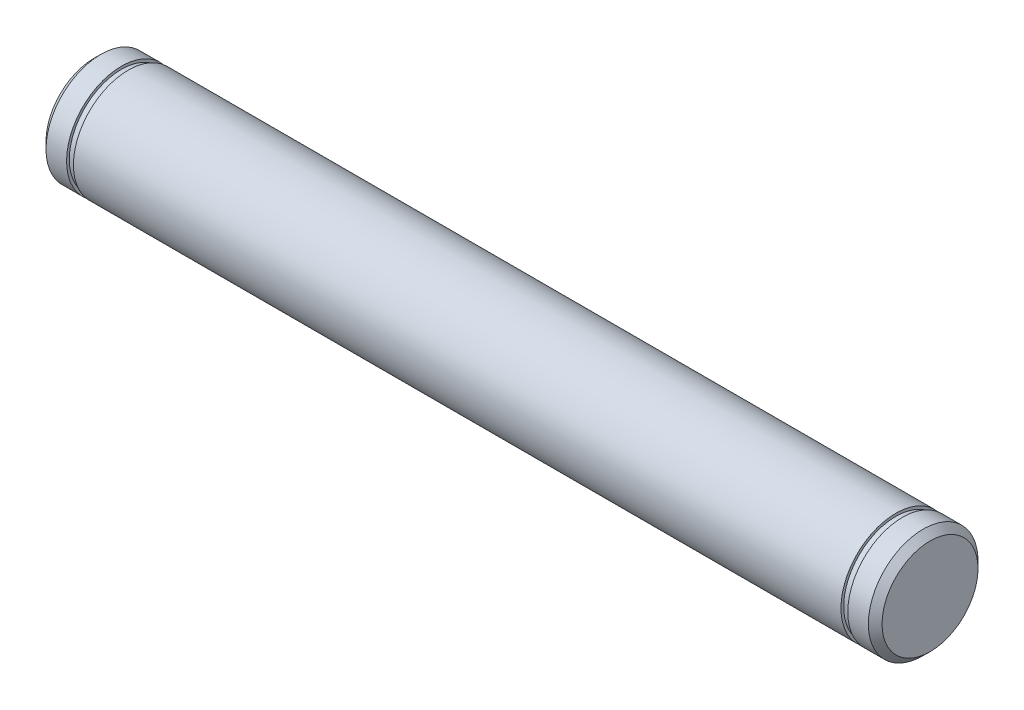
from build123d import *

# Parameters (mm, degrees)
SKETCH1_R           = 2
BOSS_EXTRUDE1_DEPTH = 30.5
CUT_EXTRUDE2_START  = -1
SKETCH2_R           = 2.498108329
SKETCH2_R_2         = 1.9
CUT_EXTRUDE2_DEPTH  = 0.25
CUT_EXTRUDE3_START  = -1.25
SKETCH3_R           = 2.5
SKETCH3_R_2         = 1.9
CUT_EXTRUDE3_DEPTH  = 0.25
CHAMFER1_SIZE       = 0.25


with BuildPart() as part:
    # Sketch1 → Boss-Extrude1 (new body)
    with BuildSketch(Plane(origin=(0, 0, 0), x_dir=(0, 0, -1), z_dir=(1, 0, 0))):
        with Locations(Location((0, 0, 0), (0, 0, 180))):
            Circle(SKETCH1_R)
    extrude(amount=BOSS_EXTRUDE1_DEPTH)

    # Sketch2 → Cut-Extrude2 (cut)
    with BuildSketch(Plane(origin=(30.5, 0, 0), x_dir=(0, 0, -1), z_dir=(1, 0, 0)).offset(CUT_EXTRUDE2_START)):
        Circle(SKETCH2_R)
        Circle(SKETCH2_R_2, mode=Mode.SUBTRACT)
    extrude(amount=-CUT_EXTRUDE2_DEPTH, mode=Mode.SUBTRACT)

    # Sketch3 → Cut-Extrude3 (cut)
    with BuildSketch(Plane.ZY.offset(CUT_EXTRUDE3_START)):
        Circle(SKETCH3_R)
        with Locations(Location((0, 0, 0), (0, 0, 180))):
            Circle(SKETCH3_R_2, mode=Mode.SUBTRACT)
    extrude(amount=CUT_EXTRUDE3_DEPTH, mode=Mode.SUBTRACT)

    # Chamfer1
    chamfer1_edges = [part.edges().sort_by_distance(p)[0] for p in [
        (0, 0, -2),
        (30.5, 0, -2),
    ]]
    chamfer(chamfer1_edges, length=CHAMFER1_SIZE)


solid = part.part
